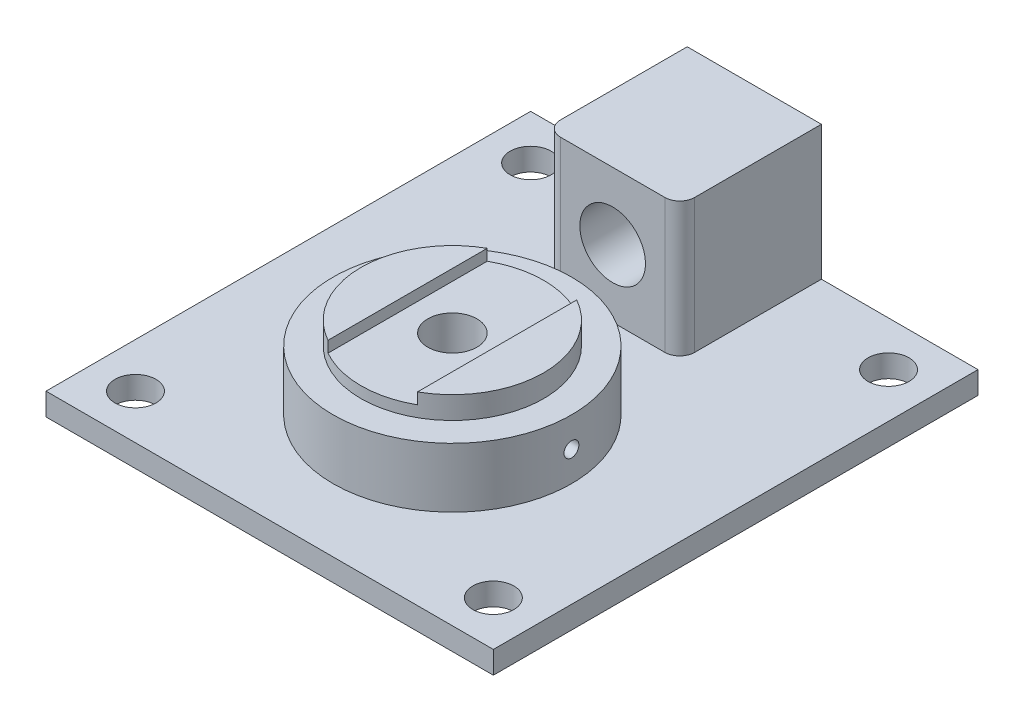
ISO-10303-21;
HEADER;
FILE_DESCRIPTION(('STEP AP214'),'2;1');
FILE_NAME('part.step','',(''),(''),'','','');
FILE_SCHEMA(('AUTOMOTIVE_DESIGN { 1 0 10303 214 1 1 1 1 }'));
ENDSEC;
DATA;
#1=APPLICATION_CONTEXT('core data for automotive mechanical design processes');
#2=APPLICATION_PROTOCOL_DEFINITION('international standard','automotive_design',2000,#1);
#3=PRODUCT_CONTEXT('',#1,'mechanical');
#4=PRODUCT('Part','Part','',(#3));
#5=PRODUCT_RELATED_PRODUCT_CATEGORY('part','',(#4));
#6=PRODUCT_DEFINITION_FORMATION('','',#4);
#7=PRODUCT_DEFINITION_CONTEXT('part definition',#1,'design');
#8=PRODUCT_DEFINITION('design','',#6,#7);
#9=PRODUCT_DEFINITION_SHAPE('','',#8);
#10=(LENGTH_UNIT() NAMED_UNIT(*) SI_UNIT(.MILLI.,.METRE.));
#11=(NAMED_UNIT(*) PLANE_ANGLE_UNIT() SI_UNIT($,.RADIAN.));
#12=(NAMED_UNIT(*) SI_UNIT($,.STERADIAN.) SOLID_ANGLE_UNIT());
#13=UNCERTAINTY_MEASURE_WITH_UNIT(LENGTH_MEASURE(1.E-05),#10,'distance_accuracy_value','');
#14=(GEOMETRIC_REPRESENTATION_CONTEXT(3) GLOBAL_UNCERTAINTY_ASSIGNED_CONTEXT((#13)) GLOBAL_UNIT_ASSIGNED_CONTEXT((#10,
#11,#12)) REPRESENTATION_CONTEXT('',''));
#15=CARTESIAN_POINT('',(0.,0.,0.));
#16=DIRECTION('',(0.,0.,1.));
#17=DIRECTION('',(1.,0.,0.));
#18=AXIS2_PLACEMENT_3D('',#15,#16,#17);
#19=CARTESIAN_POINT('',(-25.1769664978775,3.,27.2175));
#20=DIRECTION('',(0.,1.,0.));
#21=DIRECTION('',(0.,0.,1.));
#22=AXIS2_PLACEMENT_3D('',#19,#20,#21);
#23=PLANE('',#22);
#24=CARTESIAN_POINT('',(28.8230335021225,3.,-31.7825));
#25=DIRECTION('',(0.,1.,0.));
#26=DIRECTION('',(0.,0.,1.));
#27=AXIS2_PLACEMENT_3D('',#24,#25,#26);
#28=CIRCLE('',#27,2.74999999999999);
#29=CARTESIAN_POINT('',(28.8230335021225,3.,-29.0325));
#30=VERTEX_POINT('',#29);
#31=EDGE_CURVE('E633',#30,#30,#28,.T.);
#32=ORIENTED_EDGE('',*,*,#31,.F.);
#33=EDGE_LOOP('',(#32));
#34=FACE_BOUND('',#33,.T.);
#35=CARTESIAN_POINT('',(-19.1769664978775,3.,-31.7825));
#36=DIRECTION('',(0.,1.,0.));
#37=DIRECTION('',(0.,0.,1.));
#38=AXIS2_PLACEMENT_3D('',#35,#36,#37);
#39=CIRCLE('',#38,2.75);
#40=CARTESIAN_POINT('',(-19.1769664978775,3.,-29.0325));
#41=VERTEX_POINT('',#40);
#42=EDGE_CURVE('E627',#41,#41,#39,.T.);
#43=ORIENTED_EDGE('',*,*,#42,.F.);
#44=EDGE_LOOP('',(#43));
#45=FACE_BOUND('',#44,.T.);
#46=CARTESIAN_POINT('',(-19.1769664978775,3.,21.2175));
#47=DIRECTION('',(0.,1.,0.));
#48=DIRECTION('',(0.,0.,1.));
#49=AXIS2_PLACEMENT_3D('',#46,#47,#48);
#50=CIRCLE('',#49,2.75);
#51=CARTESIAN_POINT('',(-19.1769664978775,3.,23.9675));
#52=VERTEX_POINT('',#51);
#53=EDGE_CURVE('E621',#52,#52,#50,.T.);
#54=ORIENTED_EDGE('',*,*,#53,.F.);
#55=EDGE_LOOP('',(#54));
#56=FACE_BOUND('',#55,.T.);
#57=CARTESIAN_POINT('',(28.8230335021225,3.,21.2175));
#58=DIRECTION('',(0.,1.,0.));
#59=DIRECTION('',(0.,0.,1.));
#60=AXIS2_PLACEMENT_3D('',#57,#58,#59);
#61=CIRCLE('',#60,2.74999999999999);
#62=CARTESIAN_POINT('',(28.8230335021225,3.,23.9675));
#63=VERTEX_POINT('',#62);
#64=EDGE_CURVE('E615',#63,#63,#61,.T.);
#65=ORIENTED_EDGE('',*,*,#64,.F.);
#66=EDGE_LOOP('',(#65));
#67=FACE_BOUND('',#66,.T.);
#68=CARTESIAN_POINT('',(4.8230335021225,3.,2.7175));
#69=DIRECTION('',(0.,1.,0.));
#70=DIRECTION('',(0.,0.,1.));
#71=AXIS2_PLACEMENT_3D('',#68,#69,#70);
#72=CIRCLE('',#71,16.);
#73=CARTESIAN_POINT('',(4.8230335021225,3.,18.7175));
#74=VERTEX_POINT('',#73);
#75=EDGE_CURVE('E203',#74,#74,#72,.T.);
#76=ORIENTED_EDGE('',*,*,#75,.F.);
#77=EDGE_LOOP('',(#76));
#78=FACE_BOUND('',#77,.T.);
#79=DIRECTION('',(-1.,0.,0.));
#80=VECTOR('',#79,1.);
#81=CARTESIAN_POINT('',(-25.1769664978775,3.,-37.7825));
#82=LINE('',#81,#80);
#83=CARTESIAN_POINT('',(34.8230335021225,3.,-37.7825));
#84=VERTEX_POINT('',#83);
#85=CARTESIAN_POINT('',(13.8230335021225,3.,-37.7825));
#86=VERTEX_POINT('',#85);
#87=EDGE_CURVE('E222',#84,#86,#82,.T.);
#88=ORIENTED_EDGE('',*,*,#87,.T.);
#89=DIRECTION('',(0.,0.,-1.));
#90=VECTOR('',#89,1.);
#91=CARTESIAN_POINT('',(13.8230335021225,3.,-18.7825));
#92=LINE('',#91,#90);
#93=CARTESIAN_POINT('',(13.8230335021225,3.,-20.7825));
#94=VERTEX_POINT('',#93);
#95=EDGE_CURVE('E157',#94,#86,#92,.T.);
#96=ORIENTED_EDGE('',*,*,#95,.F.);
#97=CARTESIAN_POINT('',(11.8230335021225,3.,-20.7825));
#98=DIRECTION('',(0.,1.,0.));
#99=DIRECTION('',(0.,0.,1.));
#100=AXIS2_PLACEMENT_3D('',#97,#98,#99);
#101=CIRCLE('',#100,2.);
#102=CARTESIAN_POINT('',(11.8230335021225,3.,-18.7825));
#103=VERTEX_POINT('',#102);
#104=EDGE_CURVE('E11',#94,#103,#101,.F.);
#105=ORIENTED_EDGE('',*,*,#104,.T.);
#106=DIRECTION('',(1.,0.,0.));
#107=VECTOR('',#106,1.);
#108=CARTESIAN_POINT('',(-4.1769664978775,3.,-18.7825));
#109=LINE('',#108,#107);
#110=CARTESIAN_POINT('',(-2.1769664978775,3.,-18.7825));
#111=VERTEX_POINT('',#110);
#112=EDGE_CURVE('E143',#111,#103,#109,.T.);
#113=ORIENTED_EDGE('',*,*,#112,.F.);
#114=CARTESIAN_POINT('',(-2.1769664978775,3.,-20.7825));
#115=DIRECTION('',(0.,1.,0.));
#116=DIRECTION('',(0.,0.,1.));
#117=AXIS2_PLACEMENT_3D('',#114,#115,#116);
#118=CIRCLE('',#117,2.);
#119=CARTESIAN_POINT('',(-4.1769664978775,3.,-20.7825));
#120=VERTEX_POINT('',#119);
#121=EDGE_CURVE('E44',#111,#120,#118,.F.);
#122=ORIENTED_EDGE('',*,*,#121,.T.);
#123=DIRECTION('',(0.,0.,1.));
#124=VECTOR('',#123,1.);
#125=CARTESIAN_POINT('',(-4.1769664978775,3.,-18.7825));
#126=LINE('',#125,#124);
#127=CARTESIAN_POINT('',(-4.1769664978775,3.,-37.7825));
#128=VERTEX_POINT('',#127);
#129=EDGE_CURVE('E340',#128,#120,#126,.T.);
#130=ORIENTED_EDGE('',*,*,#129,.F.);
#131=CARTESIAN_POINT('',(-25.1769664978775,3.,-37.7825));
#132=VERTEX_POINT('',#131);
#133=EDGE_CURVE('E221',#128,#132,#82,.T.);
#134=ORIENTED_EDGE('',*,*,#133,.T.);
#135=DIRECTION('',(0.,0.,1.));
#136=VECTOR('',#135,1.);
#137=CARTESIAN_POINT('',(-25.1769664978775,3.,-37.7825));
#138=LINE('',#137,#136);
#139=CARTESIAN_POINT('',(-25.1769664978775,3.,27.2175));
#140=VERTEX_POINT('',#139);
#141=EDGE_CURVE('E213',#132,#140,#138,.T.);
#142=ORIENTED_EDGE('',*,*,#141,.T.);
#143=DIRECTION('',(1.,0.,0.));
#144=VECTOR('',#143,1.);
#145=CARTESIAN_POINT('',(-25.1769664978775,3.,27.2175));
#146=LINE('',#145,#144);
#147=CARTESIAN_POINT('',(34.8230335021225,3.,27.2175));
#148=VERTEX_POINT('',#147);
#149=EDGE_CURVE('E216',#140,#148,#146,.T.);
#150=ORIENTED_EDGE('',*,*,#149,.T.);
#151=DIRECTION('',(0.,0.,-1.));
#152=VECTOR('',#151,1.);
#153=CARTESIAN_POINT('',(34.8230335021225,3.,-37.7825));
#154=LINE('',#153,#152);
#155=EDGE_CURVE('E219',#148,#84,#154,.T.);
#156=ORIENTED_EDGE('',*,*,#155,.T.);
#157=EDGE_LOOP('',(#88,#96,#105,#113,#122,#130,#134,#142,#150,#156));
#158=FACE_BOUND('',#157,.T.);
#159=ADVANCED_FACE('F31',(#34,#45,#56,#67,#78,#158),#23,.T.);
#160=CARTESIAN_POINT('',(4.8230335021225,14.,2.7175));
#161=DIRECTION('',(0.,1.,0.));
#162=DIRECTION('',(0.,0.,1.));
#163=AXIS2_PLACEMENT_3D('',#160,#161,#162);
#164=PLANE('',#163);
#165=DIRECTION('',(0.,0.,-1.));
#166=VECTOR('',#165,1.);
#167=CARTESIAN_POINT('',(10.8230335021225,14.,-7.96250468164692));
#168=LINE('',#167,#166);
#169=CARTESIAN_POINT('',(10.8230335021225,14.,13.3975046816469));
#170=VERTEX_POINT('',#169);
#171=CARTESIAN_POINT('',(10.8230335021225,14.,-7.96250468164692));
#172=VERTEX_POINT('',#171);
#173=EDGE_CURVE('E178',#170,#172,#168,.T.);
#174=ORIENTED_EDGE('',*,*,#173,.F.);
#175=CARTESIAN_POINT('',(4.8230335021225,14.,2.7175));
#176=DIRECTION('',(0.,1.,0.));
#177=DIRECTION('',(0.,0.,1.));
#178=AXIS2_PLACEMENT_3D('',#175,#176,#177);
#179=CIRCLE('',#178,12.25);
#180=EDGE_CURVE('E200',#170,#172,#179,.T.);
#181=ORIENTED_EDGE('',*,*,#180,.T.);
#182=EDGE_LOOP('',(#174,#181));
#183=FACE_BOUND('',#182,.T.);
#184=ADVANCED_FACE('F300',(#183),#164,.T.);
#185=CARTESIAN_POINT('',(4.8230335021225,11.,2.7175));
#186=DIRECTION('',(0.,1.,0.));
#187=DIRECTION('',(0.,0.,1.));
#188=AXIS2_PLACEMENT_3D('',#185,#186,#187);
#189=PLANE('',#188);
#190=CARTESIAN_POINT('',(4.8230335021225,11.,2.7175));
#191=DIRECTION('',(0.,1.,0.));
#192=DIRECTION('',(0.,0.,1.));
#193=AXIS2_PLACEMENT_3D('',#190,#191,#192);
#194=CIRCLE('',#193,16.);
#195=CARTESIAN_POINT('',(4.8230335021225,11.,18.7175));
#196=VERTEX_POINT('',#195);
#197=EDGE_CURVE('E207',#196,#196,#194,.T.);
#198=ORIENTED_EDGE('',*,*,#197,.T.);
#199=EDGE_LOOP('',(#198));
#200=FACE_BOUND('',#199,.T.);
#201=CARTESIAN_POINT('',(4.8230335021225,11.,2.7175));
#202=DIRECTION('',(0.,1.,0.));
#203=DIRECTION('',(0.,0.,1.));
#204=AXIS2_PLACEMENT_3D('',#201,#202,#203);
#205=CIRCLE('',#204,12.25);
#206=CARTESIAN_POINT('',(4.8230335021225,11.,14.9675));
#207=VERTEX_POINT('',#206);
#208=EDGE_CURVE('E193',#207,#207,#205,.T.);
#209=ORIENTED_EDGE('',*,*,#208,.F.);
#210=EDGE_LOOP('',(#209));
#211=FACE_BOUND('',#210,.T.);
#212=ADVANCED_FACE('F295',(#200,#211),#189,.T.);
#213=CARTESIAN_POINT('',(-25.1769664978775,3.,-37.7825));
#214=DIRECTION('',(1.,0.,0.));
#215=DIRECTION('',(0.,0.,-1.));
#216=AXIS2_PLACEMENT_3D('',#213,#214,#215);
#217=PLANE('',#216);
#218=DIRECTION('',(0.,0.,1.));
#219=VECTOR('',#218,1.);
#220=CARTESIAN_POINT('',(-25.1769664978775,0.,-37.7825));
#221=LINE('',#220,#219);
#222=CARTESIAN_POINT('',(-25.1769664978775,0.,-37.7825));
#223=VERTEX_POINT('',#222);
#224=CARTESIAN_POINT('',(-25.1769664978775,0.,27.2175));
#225=VERTEX_POINT('',#224);
#226=EDGE_CURVE('E210',#223,#225,#221,.T.);
#227=ORIENTED_EDGE('',*,*,#226,.T.);
#228=DIRECTION('',(0.,-1.,0.));
#229=VECTOR('',#228,1.);
#230=CARTESIAN_POINT('',(-25.1769664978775,3.,27.2175));
#231=LINE('',#230,#229);
#232=EDGE_CURVE('E240',#140,#225,#231,.T.);
#233=ORIENTED_EDGE('',*,*,#232,.F.);
#234=ORIENTED_EDGE('',*,*,#141,.F.);
#235=DIRECTION('',(0.,-1.,0.));
#236=VECTOR('',#235,1.);
#237=CARTESIAN_POINT('',(-25.1769664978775,3.,-37.7825));
#238=LINE('',#237,#236);
#239=EDGE_CURVE('E224',#132,#223,#238,.T.);
#240=ORIENTED_EDGE('',*,*,#239,.T.);
#241=EDGE_LOOP('',(#227,#233,#234,#240));
#242=FACE_BOUND('',#241,.T.);
#243=ADVANCED_FACE('F315',(#242),#217,.F.);
#244=CARTESIAN_POINT('',(-25.1769664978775,3.,27.2175));
#245=DIRECTION('',(0.,0.,-1.));
#246=DIRECTION('',(-1.,0.,0.));
#247=AXIS2_PLACEMENT_3D('',#244,#245,#246);
#248=PLANE('',#247);
#249=DIRECTION('',(1.,0.,0.));
#250=VECTOR('',#249,1.);
#251=CARTESIAN_POINT('',(-25.1769664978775,0.,27.2175));
#252=LINE('',#251,#250);
#253=CARTESIAN_POINT('',(34.8230335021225,0.,27.2175));
#254=VERTEX_POINT('',#253);
#255=EDGE_CURVE('E227',#225,#254,#252,.T.);
#256=ORIENTED_EDGE('',*,*,#255,.T.);
#257=DIRECTION('',(0.,-1.,0.));
#258=VECTOR('',#257,1.);
#259=CARTESIAN_POINT('',(34.8230335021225,3.,27.2175));
#260=LINE('',#259,#258);
#261=EDGE_CURVE('E237',#148,#254,#260,.T.);
#262=ORIENTED_EDGE('',*,*,#261,.F.);
#263=ORIENTED_EDGE('',*,*,#149,.F.);
#264=ORIENTED_EDGE('',*,*,#232,.T.);
#265=EDGE_LOOP('',(#256,#262,#263,#264));
#266=FACE_BOUND('',#265,.T.);
#267=ADVANCED_FACE('F311',(#266),#248,.F.);
#268=CARTESIAN_POINT('',(34.8230335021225,3.,-37.7825));
#269=DIRECTION('',(-1.,0.,0.));
#270=DIRECTION('',(0.,0.,1.));
#271=AXIS2_PLACEMENT_3D('',#268,#269,#270);
#272=PLANE('',#271);
#273=DIRECTION('',(0.,0.,-1.));
#274=VECTOR('',#273,1.);
#275=CARTESIAN_POINT('',(34.8230335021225,0.,-37.7825));
#276=LINE('',#275,#274);
#277=CARTESIAN_POINT('',(34.8230335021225,0.,-37.7825));
#278=VERTEX_POINT('',#277);
#279=EDGE_CURVE('E229',#254,#278,#276,.T.);
#280=ORIENTED_EDGE('',*,*,#279,.T.);
#281=DIRECTION('',(0.,-1.,0.));
#282=VECTOR('',#281,1.);
#283=CARTESIAN_POINT('',(34.8230335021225,3.,-37.7825));
#284=LINE('',#283,#282);
#285=EDGE_CURVE('E234',#84,#278,#284,.T.);
#286=ORIENTED_EDGE('',*,*,#285,.F.);
#287=ORIENTED_EDGE('',*,*,#155,.F.);
#288=ORIENTED_EDGE('',*,*,#261,.T.);
#289=EDGE_LOOP('',(#280,#286,#287,#288));
#290=FACE_BOUND('',#289,.T.);
#291=ADVANCED_FACE('F307',(#290),#272,.F.);
#292=CARTESIAN_POINT('',(-25.1769664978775,3.,-37.7825));
#293=DIRECTION('',(0.,0.,1.));
#294=DIRECTION('',(1.,0.,0.));
#295=AXIS2_PLACEMENT_3D('',#292,#293,#294);
#296=PLANE('',#295);
#297=CARTESIAN_POINT('',(4.8230335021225,12.,-37.7825));
#298=DIRECTION('',(0.,0.,-1.));
#299=DIRECTION('',(-1.,0.,0.));
#300=AXIS2_PLACEMENT_3D('',#297,#298,#299);
#301=CIRCLE('',#300,4.39999999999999);
#302=CARTESIAN_POINT('',(0.423033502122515,12.,-37.7825));
#303=VERTEX_POINT('',#302);
#304=EDGE_CURVE('E610',#303,#303,#301,.T.);
#305=ORIENTED_EDGE('',*,*,#304,.F.);
#306=EDGE_LOOP('',(#305));
#307=FACE_BOUND('',#306,.T.);
#308=DIRECTION('',(-1.,0.,0.));
#309=VECTOR('',#308,1.);
#310=CARTESIAN_POINT('',(-25.1769664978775,0.,-37.7825));
#311=LINE('',#310,#309);
#312=EDGE_CURVE('E217',#278,#223,#311,.T.);
#313=ORIENTED_EDGE('',*,*,#312,.T.);
#314=ORIENTED_EDGE('',*,*,#239,.F.);
#315=ORIENTED_EDGE('',*,*,#133,.F.);
#316=DIRECTION('',(0.,-1.,0.));
#317=VECTOR('',#316,1.);
#318=CARTESIAN_POINT('',(-4.1769664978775,21.,-37.7825));
#319=LINE('',#318,#317);
#320=CARTESIAN_POINT('',(-4.1769664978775,21.,-37.7825));
#321=VERTEX_POINT('',#320);
#322=EDGE_CURVE('E151',#321,#128,#319,.T.);
#323=ORIENTED_EDGE('',*,*,#322,.F.);
#324=DIRECTION('',(-1.,0.,0.));
#325=VECTOR('',#324,1.);
#326=CARTESIAN_POINT('',(-4.1769664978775,21.,-37.7825));
#327=LINE('',#326,#325);
#328=CARTESIAN_POINT('',(13.8230335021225,21.,-37.7825));
#329=VERTEX_POINT('',#328);
#330=EDGE_CURVE('E139',#329,#321,#327,.T.);
#331=ORIENTED_EDGE('',*,*,#330,.F.);
#332=DIRECTION('',(0.,-1.,0.));
#333=VECTOR('',#332,1.);
#334=CARTESIAN_POINT('',(13.8230335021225,21.,-37.7825));
#335=LINE('',#334,#333);
#336=EDGE_CURVE('E149',#329,#86,#335,.T.);
#337=ORIENTED_EDGE('',*,*,#336,.T.);
#338=ORIENTED_EDGE('',*,*,#87,.F.);
#339=ORIENTED_EDGE('',*,*,#285,.T.);
#340=EDGE_LOOP('',(#313,#314,#315,#323,#331,#337,#338,#339));
#341=FACE_BOUND('',#340,.T.);
#342=ADVANCED_FACE('F147',(#307,#341),#296,.F.);
#343=CARTESIAN_POINT('',(-25.1769664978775,0.,27.2175));
#344=DIRECTION('',(0.,1.,0.));
#345=DIRECTION('',(0.,0.,1.));
#346=AXIS2_PLACEMENT_3D('',#343,#344,#345);
#347=PLANE('',#346);
#348=CARTESIAN_POINT('',(28.8230335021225,0.,-31.7825));
#349=DIRECTION('',(0.,1.,0.));
#350=DIRECTION('',(0.,0.,1.));
#351=AXIS2_PLACEMENT_3D('',#348,#349,#350);
#352=CIRCLE('',#351,2.74999999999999);
#353=CARTESIAN_POINT('',(28.8230335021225,0.,-29.0325));
#354=VERTEX_POINT('',#353);
#355=EDGE_CURVE('E630',#354,#354,#352,.T.);
#356=ORIENTED_EDGE('',*,*,#355,.T.);
#357=EDGE_LOOP('',(#356));
#358=FACE_BOUND('',#357,.T.);
#359=CARTESIAN_POINT('',(-19.1769664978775,0.,-31.7825));
#360=DIRECTION('',(0.,1.,0.));
#361=DIRECTION('',(0.,0.,1.));
#362=AXIS2_PLACEMENT_3D('',#359,#360,#361);
#363=CIRCLE('',#362,2.75);
#364=CARTESIAN_POINT('',(-19.1769664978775,0.,-29.0325));
#365=VERTEX_POINT('',#364);
#366=EDGE_CURVE('E624',#365,#365,#363,.T.);
#367=ORIENTED_EDGE('',*,*,#366,.T.);
#368=EDGE_LOOP('',(#367));
#369=FACE_BOUND('',#368,.T.);
#370=CARTESIAN_POINT('',(-19.1769664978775,0.,21.2175));
#371=DIRECTION('',(0.,1.,0.));
#372=DIRECTION('',(0.,0.,1.));
#373=AXIS2_PLACEMENT_3D('',#370,#371,#372);
#374=CIRCLE('',#373,2.75);
#375=CARTESIAN_POINT('',(-19.1769664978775,0.,23.9675));
#376=VERTEX_POINT('',#375);
#377=EDGE_CURVE('E619',#376,#376,#374,.T.);
#378=ORIENTED_EDGE('',*,*,#377,.T.);
#379=EDGE_LOOP('',(#378));
#380=FACE_BOUND('',#379,.T.);
#381=CARTESIAN_POINT('',(28.8230335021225,0.,21.2175));
#382=DIRECTION('',(0.,1.,0.));
#383=DIRECTION('',(0.,0.,1.));
#384=AXIS2_PLACEMENT_3D('',#381,#382,#383);
#385=CIRCLE('',#384,2.74999999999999);
#386=CARTESIAN_POINT('',(28.8230335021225,0.,23.9675));
#387=VERTEX_POINT('',#386);
#388=EDGE_CURVE('E611',#387,#387,#385,.T.);
#389=ORIENTED_EDGE('',*,*,#388,.T.);
#390=EDGE_LOOP('',(#389));
#391=FACE_BOUND('',#390,.T.);
#392=CARTESIAN_POINT('',(4.8230335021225,0.,2.71749999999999));
#393=DIRECTION('',(0.,-1.,0.));
#394=DIRECTION('',(0.,0.,-1.));
#395=AXIS2_PLACEMENT_3D('',#392,#393,#394);
#396=CIRCLE('',#395,5.75);
#397=CARTESIAN_POINT('',(4.8230335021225,0.,-3.03250000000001));
#398=VERTEX_POINT('',#397);
#399=EDGE_CURVE('E159',#398,#398,#396,.T.);
#400=ORIENTED_EDGE('',*,*,#399,.F.);
#401=EDGE_LOOP('',(#400));
#402=FACE_BOUND('',#401,.T.);
#403=ORIENTED_EDGE('',*,*,#226,.F.);
#404=ORIENTED_EDGE('',*,*,#312,.F.);
#405=ORIENTED_EDGE('',*,*,#279,.F.);
#406=ORIENTED_EDGE('',*,*,#255,.F.);
#407=EDGE_LOOP('',(#403,#404,#405,#406));
#408=FACE_BOUND('',#407,.T.);
#409=ADVANCED_FACE('F293',(#358,#369,#380,#391,#402,#408),#347,.F.);
#410=CARTESIAN_POINT('',(4.8230335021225,11.,2.7175));
#411=DIRECTION('',(0.,-1.,0.));
#412=DIRECTION('',(0.,0.,-1.));
#413=AXIS2_PLACEMENT_3D('',#410,#411,#412);
#414=CYLINDRICAL_SURFACE('',#413,16.);
#415=CARTESIAN_POINT('',(-11.1456859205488,7.,1.7175));
#416=CARTESIAN_POINT('',(-11.1456863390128,7.0561115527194,1.71750246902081));
#417=CARTESIAN_POINT('',(-11.1459848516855,7.11226239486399,1.72223863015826));
#418=CARTESIAN_POINT('',(-11.1471467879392,7.2230136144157,1.74106412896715));
#419=CARTESIAN_POINT('',(-11.1480108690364,7.27761210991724,1.75516435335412));
#420=CARTESIAN_POINT('',(-11.1502056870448,7.38363835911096,1.79231138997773));
#421=CARTESIAN_POINT('',(-11.1515361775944,7.43506776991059,1.81535347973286));
#422=CARTESIAN_POINT('',(-11.1545135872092,7.53331542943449,1.86972252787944));
#423=CARTESIAN_POINT('',(-11.1561604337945,7.58013473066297,1.90104758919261));
#424=CARTESIAN_POINT('',(-11.1595877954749,7.66791696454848,1.97114501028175));
#425=CARTESIAN_POINT('',(-11.1613684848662,7.70887205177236,2.00992718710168));
#426=CARTESIAN_POINT('',(-11.1648612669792,7.78369615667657,2.09381771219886));
#427=CARTESIAN_POINT('',(-11.1665733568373,7.81756487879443,2.13892632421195));
#428=CARTESIAN_POINT('',(-11.1697375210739,7.8772787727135,2.23423329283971));
#429=CARTESIAN_POINT('',(-11.1711893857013,7.90311748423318,2.28443570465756));
#430=CARTESIAN_POINT('',(-11.173667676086,7.94599651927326,2.38847676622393));
#431=CARTESIAN_POINT('',(-11.1746941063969,7.96303693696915,2.4423153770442));
#432=CARTESIAN_POINT('',(-11.1762046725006,7.98781398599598,2.55202525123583));
#433=CARTESIAN_POINT('',(-11.1766895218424,7.99556286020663,2.6078937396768));
#434=CARTESIAN_POINT('',(-11.1770646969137,8.001574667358,2.72014039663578));
#435=CARTESIAN_POINT('',(-11.1769550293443,7.99983770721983,2.77651855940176));
#436=CARTESIAN_POINT('',(-11.1761541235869,7.98693725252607,2.88810126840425));
#437=CARTESIAN_POINT('',(-11.1754636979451,7.97578692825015,2.94330734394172));
#438=CARTESIAN_POINT('',(-11.1735799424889,7.94439669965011,3.05106269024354));
#439=CARTESIAN_POINT('',(-11.1723866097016,7.9241567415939,3.10361194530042));
#440=CARTESIAN_POINT('',(-11.1696300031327,7.87514687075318,3.20460424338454));
#441=CARTESIAN_POINT('',(-11.1680664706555,7.8463709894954,3.25304438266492));
#442=CARTESIAN_POINT('',(-11.1647454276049,7.78111045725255,3.3444116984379));
#443=CARTESIAN_POINT('',(-11.1629879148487,7.74462571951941,3.38733881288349));
#444=CARTESIAN_POINT('',(-11.1594731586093,7.6649087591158,3.4665384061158));
#445=CARTESIAN_POINT('',(-11.1577159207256,7.62166510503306,3.50279938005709));
#446=CARTESIAN_POINT('',(-11.1544028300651,7.5296978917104,3.5675486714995));
#447=CARTESIAN_POINT('',(-11.1528469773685,7.48097433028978,3.5960369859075));
#448=CARTESIAN_POINT('',(-11.1501123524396,7.37942307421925,3.64443145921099));
#449=CARTESIAN_POINT('',(-11.1489336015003,7.32659514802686,3.66433713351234));
#450=CARTESIAN_POINT('',(-11.1470868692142,7.21833810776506,3.69499333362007));
#451=CARTESIAN_POINT('',(-11.1464188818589,7.16290902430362,3.70574396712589));
#452=CARTESIAN_POINT('',(-11.1456701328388,7.05112345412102,3.71777058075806));
#453=CARTESIAN_POINT('',(-11.1455883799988,6.99476869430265,3.71906255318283));
#454=CARTESIAN_POINT('',(-11.1460187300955,6.88264326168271,3.71217695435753));
#455=CARTESIAN_POINT('',(-11.1465308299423,6.82687258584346,3.70399943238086));
#456=CARTESIAN_POINT('',(-11.1480902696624,6.71754367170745,3.67842025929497));
#457=CARTESIAN_POINT('',(-11.1491371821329,6.66398370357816,3.66102597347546));
#458=CARTESIAN_POINT('',(-11.1516479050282,6.56054318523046,3.61751449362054));
#459=CARTESIAN_POINT('',(-11.1531117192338,6.51066266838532,3.59139722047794));
#460=CARTESIAN_POINT('',(-11.1562936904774,6.41592351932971,3.53114027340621));
#461=CARTESIAN_POINT('',(-11.158012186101,6.37107171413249,3.49698988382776));
#462=CARTESIAN_POINT('',(-11.1615086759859,6.28773194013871,3.42165170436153));
#463=CARTESIAN_POINT('',(-11.1632866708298,6.24924403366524,3.38046384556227));
#464=CARTESIAN_POINT('',(-11.1667047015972,6.17967057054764,3.29215107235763));
#465=CARTESIAN_POINT('',(-11.1683445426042,6.14859536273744,3.24501799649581));
#466=CARTESIAN_POINT('',(-11.1712986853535,6.09480022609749,3.14619377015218));
#467=CARTESIAN_POINT('',(-11.1726129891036,6.0720802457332,3.09450264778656));
#468=CARTESIAN_POINT('',(-11.1747670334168,6.03565850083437,2.98806769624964));
#469=CARTESIAN_POINT('',(-11.1756071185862,6.02195018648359,2.93332611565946));
#470=CARTESIAN_POINT('',(-11.1767194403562,6.00391946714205,2.82231289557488));
#471=CARTESIAN_POINT('',(-11.1769916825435,5.9995969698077,2.76604127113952));
#472=CARTESIAN_POINT('',(-11.1769376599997,6.00046148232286,2.65366774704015));
#473=CARTESIAN_POINT('',(-11.1766124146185,6.00563229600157,2.59756572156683));
#474=CARTESIAN_POINT('',(-11.1754020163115,6.02530307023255,2.48702813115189));
#475=CARTESIAN_POINT('',(-11.1745168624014,6.03980304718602,2.43259256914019));
#476=CARTESIAN_POINT('',(-11.1722861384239,6.07771689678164,2.32693068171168));
#477=CARTESIAN_POINT('',(-11.1709405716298,6.10113070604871,2.27570433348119));
#478=CARTESIAN_POINT('',(-11.1679400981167,6.15620532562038,2.17790772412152));
#479=CARTESIAN_POINT('',(-11.1662851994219,6.18786592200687,2.13133734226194));
#480=CARTESIAN_POINT('',(-11.1628488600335,6.25859519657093,2.0440925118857));
#481=CARTESIAN_POINT('',(-11.1610672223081,6.29767557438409,2.00342755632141));
#482=CARTESIAN_POINT('',(-11.1575797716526,6.38211952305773,1.92922128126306));
#483=CARTESIAN_POINT('',(-11.1558739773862,6.42748462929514,1.89568170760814));
#484=CARTESIAN_POINT('',(-11.1527289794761,6.52326214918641,1.83665341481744));
#485=CARTESIAN_POINT('',(-11.1512901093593,6.57368075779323,1.81117474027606));
#486=CARTESIAN_POINT('',(-11.1488461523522,6.67805250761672,1.76907543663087));
#487=CARTESIAN_POINT('',(-11.1478405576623,6.73200142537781,1.75244443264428));
#488=CARTESIAN_POINT('',(-11.1466405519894,6.82190033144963,1.73283511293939));
#489=CARTESIAN_POINT('',(-11.146284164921,6.85726921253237,1.72709188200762));
#490=CARTESIAN_POINT('',(-11.145806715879,6.92842006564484,1.71942354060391));
#491=CARTESIAN_POINT('',(-11.1456856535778,6.96420203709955,1.71749842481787));
#492=CARTESIAN_POINT('',(-11.1456859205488,7.,1.7175));
#493=B_SPLINE_CURVE_WITH_KNOTS('',3,(#415,#416,#417,#418,#419,#420,#421,#422,#423,#424,#425,
#426,#427,#428,#429,#430,#431,#432,#433,#434,#435,#436,#437,#438,#439,#440,#441,#442,#443,#444,
#445,#446,#447,#448,#449,#450,#451,#452,#453,#454,#455,#456,#457,#458,#459,#460,#461,#462,#463,
#464,#465,#466,#467,#468,#469,#470,#471,#472,#473,#474,#475,#476,#477,#478,#479,#480,#481,#482,
#483,#484,#485,#486,#487,#488,#489,#490,#491,#492),.UNSPECIFIED.,.T.,.F.,(4,2,2,2,2,2,2,2,2,2,2,
2,2,2,2,2,2,2,2,2,2,2,2,2,2,2,2,2,2,2,2,2,2,2,2,2,2,2,4),(0.,0.168203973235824,
0.336603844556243,0.504914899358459,0.673187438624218,0.841683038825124,1.01018566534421,
1.17882350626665,1.3474595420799,1.51587313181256,1.68428482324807,1.85246127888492,
2.02063872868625,2.18893404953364,2.35723126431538,2.52581626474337,2.69440133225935,
2.86299591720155,3.03158851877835,3.1998960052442,3.36820261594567,3.53637493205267,
3.70454877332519,3.87294823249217,4.04134934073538,4.20998419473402,4.37861800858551,
4.54712912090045,4.71563857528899,4.88386080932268,5.05208333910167,5.22030467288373,
5.38852164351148,5.55700609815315,5.72553178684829,5.89426665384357,6.06280322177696,
6.17011388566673,6.27742440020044),.UNSPECIFIED.);
#494=CARTESIAN_POINT('',(-11.1456859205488,7.,1.7175));
#495=VERTEX_POINT('',#494);
#496=EDGE_CURVE('E283',#495,#495,#493,.T.);
#497=ORIENTED_EDGE('',*,*,#496,.T.);
#498=EDGE_LOOP('',(#497));
#499=FACE_BOUND('',#498,.T.);
#500=CARTESIAN_POINT('',(20.7917529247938,7.,1.7175));
#501=CARTESIAN_POINT('',(20.7917533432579,6.9438884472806,1.71750246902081));
#502=CARTESIAN_POINT('',(20.7920518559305,6.88773760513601,1.72223863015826));
#503=CARTESIAN_POINT('',(20.7932137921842,6.7769863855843,1.74106412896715));
#504=CARTESIAN_POINT('',(20.7940778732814,6.72238789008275,1.75516435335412));
#505=CARTESIAN_POINT('',(20.7962726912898,6.61636164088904,1.79231138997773));
#506=CARTESIAN_POINT('',(20.7976031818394,6.5649322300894,1.81535347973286));
#507=CARTESIAN_POINT('',(20.8005805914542,6.46668457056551,1.86972252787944));
#508=CARTESIAN_POINT('',(20.8022274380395,6.41986526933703,1.90104758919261));
#509=CARTESIAN_POINT('',(20.8056547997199,6.33208303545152,1.97114501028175));
#510=CARTESIAN_POINT('',(20.8074354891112,6.29112794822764,2.00992718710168));
#511=CARTESIAN_POINT('',(20.8109282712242,6.21630384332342,2.09381771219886));
#512=CARTESIAN_POINT('',(20.8126403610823,6.18243512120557,2.13892632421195));
#513=CARTESIAN_POINT('',(20.8158045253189,6.1227212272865,2.23423329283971));
#514=CARTESIAN_POINT('',(20.8172563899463,6.09688251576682,2.28443570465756));
#515=CARTESIAN_POINT('',(20.819734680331,6.05400348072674,2.38847676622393));
#516=CARTESIAN_POINT('',(20.8207611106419,6.03696306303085,2.4423153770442));
#517=CARTESIAN_POINT('',(20.8222716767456,6.01218601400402,2.55202525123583));
#518=CARTESIAN_POINT('',(20.8227565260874,6.00443713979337,2.6078937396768));
#519=CARTESIAN_POINT('',(20.8231317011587,5.998425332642,2.72014039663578));
#520=CARTESIAN_POINT('',(20.8230220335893,6.00016229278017,2.77651855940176));
#521=CARTESIAN_POINT('',(20.8222211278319,6.01306274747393,2.88810126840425));
#522=CARTESIAN_POINT('',(20.8215307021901,6.02421307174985,2.94330734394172));
#523=CARTESIAN_POINT('',(20.8196469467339,6.05560330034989,3.05106269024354));
#524=CARTESIAN_POINT('',(20.8184536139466,6.0758432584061,3.10361194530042));
#525=CARTESIAN_POINT('',(20.8156970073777,6.12485312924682,3.20460424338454));
#526=CARTESIAN_POINT('',(20.8141334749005,6.15362901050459,3.25304438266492));
#527=CARTESIAN_POINT('',(20.8108124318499,6.21888954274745,3.3444116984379));
#528=CARTESIAN_POINT('',(20.8090549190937,6.25537428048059,3.38733881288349));
#529=CARTESIAN_POINT('',(20.8055401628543,6.3350912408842,3.4665384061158));
#530=CARTESIAN_POINT('',(20.8037829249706,6.37833489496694,3.50279938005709));
#531=CARTESIAN_POINT('',(20.8004698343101,6.4703021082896,3.5675486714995));
#532=CARTESIAN_POINT('',(20.7989139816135,6.51902566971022,3.5960369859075));
#533=CARTESIAN_POINT('',(20.7961793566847,6.62057692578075,3.64443145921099));
#534=CARTESIAN_POINT('',(20.7950006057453,6.67340485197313,3.66433713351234));
#535=CARTESIAN_POINT('',(20.7931538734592,6.78166189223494,3.69499333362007));
#536=CARTESIAN_POINT('',(20.7924858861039,6.83709097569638,3.70574396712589));
#537=CARTESIAN_POINT('',(20.7917371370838,6.94887654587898,3.71777058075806));
#538=CARTESIAN_POINT('',(20.7916553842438,7.00523130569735,3.71906255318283));
#539=CARTESIAN_POINT('',(20.7920857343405,7.11735673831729,3.71217695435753));
#540=CARTESIAN_POINT('',(20.7925978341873,7.17312741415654,3.70399943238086));
#541=CARTESIAN_POINT('',(20.7941572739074,7.28245632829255,3.67842025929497));
#542=CARTESIAN_POINT('',(20.7952041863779,7.33601629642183,3.66102597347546));
#543=CARTESIAN_POINT('',(20.7977149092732,7.43945681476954,3.61751449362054));
#544=CARTESIAN_POINT('',(20.7991787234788,7.48933733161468,3.59139722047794));
#545=CARTESIAN_POINT('',(20.8023606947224,7.58407648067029,3.53114027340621));
#546=CARTESIAN_POINT('',(20.804079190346,7.62892828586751,3.49698988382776));
#547=CARTESIAN_POINT('',(20.8075756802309,7.71226805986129,3.42165170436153));
#548=CARTESIAN_POINT('',(20.8093536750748,7.75075596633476,3.38046384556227));
#549=CARTESIAN_POINT('',(20.8127717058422,7.82032942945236,3.29215107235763));
#550=CARTESIAN_POINT('',(20.8144115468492,7.85140463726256,3.24501799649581));
#551=CARTESIAN_POINT('',(20.8173656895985,7.90519977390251,3.14619377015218));
#552=CARTESIAN_POINT('',(20.8186799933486,7.9279197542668,3.09450264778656));
#553=CARTESIAN_POINT('',(20.8208340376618,7.96434149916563,2.98806769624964));
#554=CARTESIAN_POINT('',(20.8216741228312,7.97804981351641,2.93332611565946));
#555=CARTESIAN_POINT('',(20.8227864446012,7.99608053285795,2.82231289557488));
#556=CARTESIAN_POINT('',(20.8230586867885,8.0004030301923,2.76604127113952));
#557=CARTESIAN_POINT('',(20.8230046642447,7.99953851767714,2.65366774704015));
#558=CARTESIAN_POINT('',(20.8226794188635,7.99436770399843,2.59756572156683));
#559=CARTESIAN_POINT('',(20.8214690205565,7.97469692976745,2.48702813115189));
#560=CARTESIAN_POINT('',(20.8205838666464,7.96019695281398,2.43259256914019));
#561=CARTESIAN_POINT('',(20.8183531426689,7.92228310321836,2.32693068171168));
#562=CARTESIAN_POINT('',(20.8170075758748,7.89886929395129,2.27570433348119));
#563=CARTESIAN_POINT('',(20.8140071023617,7.84379467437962,2.17790772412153));
#564=CARTESIAN_POINT('',(20.8123522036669,7.81213407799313,2.13133734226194));
#565=CARTESIAN_POINT('',(20.8089158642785,7.74140480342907,2.0440925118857));
#566=CARTESIAN_POINT('',(20.8071342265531,7.70232442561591,2.00342755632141));
#567=CARTESIAN_POINT('',(20.8036467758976,7.61788047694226,1.92922128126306));
#568=CARTESIAN_POINT('',(20.8019409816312,7.57251537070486,1.89568170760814));
#569=CARTESIAN_POINT('',(20.7987959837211,7.47673785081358,1.83665341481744));
#570=CARTESIAN_POINT('',(20.7973571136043,7.42631924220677,1.81117474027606));
#571=CARTESIAN_POINT('',(20.7949131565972,7.32194749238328,1.76907543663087));
#572=CARTESIAN_POINT('',(20.7939075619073,7.26799857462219,1.75244443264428));
#573=CARTESIAN_POINT('',(20.7927075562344,7.17809966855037,1.73283511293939));
#574=CARTESIAN_POINT('',(20.792351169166,7.14273078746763,1.72709188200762));
#575=CARTESIAN_POINT('',(20.791873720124,7.07157993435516,1.71942354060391));
#576=CARTESIAN_POINT('',(20.7917526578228,7.03579796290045,1.71749842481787));
#577=CARTESIAN_POINT('',(20.7917529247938,7.,1.7175));
#578=B_SPLINE_CURVE_WITH_KNOTS('',3,(#500,#501,#502,#503,#504,#505,#506,#507,#508,#509,#510,
#511,#512,#513,#514,#515,#516,#517,#518,#519,#520,#521,#522,#523,#524,#525,#526,#527,#528,#529,
#530,#531,#532,#533,#534,#535,#536,#537,#538,#539,#540,#541,#542,#543,#544,#545,#546,#547,#548,
#549,#550,#551,#552,#553,#554,#555,#556,#557,#558,#559,#560,#561,#562,#563,#564,#565,#566,#567,
#568,#569,#570,#571,#572,#573,#574,#575,#576,#577),.UNSPECIFIED.,.T.,.F.,(4,2,2,2,2,2,2,2,2,2,2,
2,2,2,2,2,2,2,2,2,2,2,2,2,2,2,2,2,2,2,2,2,2,2,2,2,2,2,4),(0.,0.168203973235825,
0.336603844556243,0.504914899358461,0.673187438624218,0.841683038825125,1.01018566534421,
1.17882350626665,1.3474595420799,1.51587313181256,1.68428482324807,1.85246127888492,
2.02063872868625,2.18893404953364,2.35723126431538,2.52581626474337,2.69440133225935,
2.86299591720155,3.03158851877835,3.1998960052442,3.36820261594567,3.53637493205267,
3.70454877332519,3.87294823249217,4.04134934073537,4.20998419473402,4.37861800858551,
4.54712912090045,4.71563857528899,4.88386080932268,5.05208333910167,5.22030467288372,
5.38852164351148,5.55700609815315,5.72553178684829,5.89426665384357,6.06280322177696,
6.17011388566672,6.27742440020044),.UNSPECIFIED.);
#579=CARTESIAN_POINT('',(20.7917529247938,7.,1.7175));
#580=VERTEX_POINT('',#579);
#581=EDGE_CURVE('E278',#580,#580,#578,.T.);
#582=ORIENTED_EDGE('',*,*,#581,.T.);
#583=EDGE_LOOP('',(#582));
#584=FACE_BOUND('',#583,.T.);
#585=ORIENTED_EDGE('',*,*,#197,.F.);
#586=EDGE_LOOP('',(#585));
#587=FACE_BOUND('',#586,.T.);
#588=ORIENTED_EDGE('',*,*,#75,.T.);
#589=EDGE_LOOP('',(#588));
#590=FACE_BOUND('',#589,.T.);
#591=ADVANCED_FACE('F287',(#499,#584,#587,#590),#414,.T.);
#592=CARTESIAN_POINT('',(4.8230335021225,14.,2.7175));
#593=DIRECTION('',(0.,-1.,0.));
#594=DIRECTION('',(0.,0.,-1.));
#595=AXIS2_PLACEMENT_3D('',#592,#593,#594);
#596=CYLINDRICAL_SURFACE('',#595,12.25);
#597=ORIENTED_EDGE('',*,*,#180,.F.);
#598=DIRECTION('',(0.,1.,0.));
#599=VECTOR('',#598,1.);
#600=CARTESIAN_POINT('',(10.8230335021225,12.5,13.3975046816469));
#601=LINE('',#600,#599);
#602=CARTESIAN_POINT('',(10.8230335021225,12.5,13.3975046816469));
#603=VERTEX_POINT('',#602);
#604=EDGE_CURVE('E194',#603,#170,#601,.T.);
#605=ORIENTED_EDGE('',*,*,#604,.F.);
#606=CARTESIAN_POINT('',(4.8230335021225,12.5,2.7175));
#607=DIRECTION('',(0.,1.,0.));
#608=DIRECTION('',(0.,0.,1.));
#609=AXIS2_PLACEMENT_3D('',#606,#607,#608);
#610=CIRCLE('',#609,12.25);
#611=CARTESIAN_POINT('',(-1.1769664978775,12.5,13.3975046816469));
#612=VERTEX_POINT('',#611);
#613=EDGE_CURVE('E181',#612,#603,#610,.T.);
#614=ORIENTED_EDGE('',*,*,#613,.F.);
#615=DIRECTION('',(0.,1.,0.));
#616=VECTOR('',#615,1.);
#617=CARTESIAN_POINT('',(-1.1769664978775,12.5,13.3975046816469));
#618=LINE('',#617,#616);
#619=CARTESIAN_POINT('',(-1.1769664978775,14.,13.3975046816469));
#620=VERTEX_POINT('',#619);
#621=EDGE_CURVE('E196',#612,#620,#618,.T.);
#622=ORIENTED_EDGE('',*,*,#621,.T.);
#623=CARTESIAN_POINT('',(-1.1769664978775,14.,-7.96250468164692));
#624=VERTEX_POINT('',#623);
#625=EDGE_CURVE('E204',#624,#620,#179,.T.);
#626=ORIENTED_EDGE('',*,*,#625,.F.);
#627=DIRECTION('',(0.,1.,0.));
#628=VECTOR('',#627,1.);
#629=CARTESIAN_POINT('',(-1.1769664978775,12.5,-7.96250468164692));
#630=LINE('',#629,#628);
#631=CARTESIAN_POINT('',(-1.1769664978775,12.5,-7.96250468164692));
#632=VERTEX_POINT('',#631);
#633=EDGE_CURVE('E186',#632,#624,#630,.T.);
#634=ORIENTED_EDGE('',*,*,#633,.F.);
#635=CARTESIAN_POINT('',(4.8230335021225,12.5,2.7175));
#636=DIRECTION('',(0.,1.,0.));
#637=DIRECTION('',(0.,0.,-1.));
#638=AXIS2_PLACEMENT_3D('',#635,#636,#637);
#639=CIRCLE('',#638,12.25);
#640=CARTESIAN_POINT('',(10.8230335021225,12.5,-7.96250468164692));
#641=VERTEX_POINT('',#640);
#642=EDGE_CURVE('E174',#641,#632,#639,.T.);
#643=ORIENTED_EDGE('',*,*,#642,.F.);
#644=DIRECTION('',(0.,1.,0.));
#645=VECTOR('',#644,1.);
#646=CARTESIAN_POINT('',(10.8230335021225,12.5,-7.96250468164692));
#647=LINE('',#646,#645);
#648=EDGE_CURVE('E190',#641,#172,#647,.T.);
#649=ORIENTED_EDGE('',*,*,#648,.T.);
#650=EDGE_LOOP('',(#597,#605,#614,#622,#626,#634,#643,#649));
#651=FACE_BOUND('',#650,.T.);
#652=ORIENTED_EDGE('',*,*,#208,.T.);
#653=EDGE_LOOP('',(#652));
#654=FACE_BOUND('',#653,.T.);
#655=ADVANCED_FACE('F292',(#651,#654),#596,.T.);
#656=DIRECTION('',(0.,0.,1.));
#657=VECTOR('',#656,1.);
#658=CARTESIAN_POINT('',(-1.1769664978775,14.,-7.96250468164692));
#659=LINE('',#658,#657);
#660=EDGE_CURVE('E187',#624,#620,#659,.T.);
#661=ORIENTED_EDGE('',*,*,#660,.F.);
#662=ORIENTED_EDGE('',*,*,#625,.T.);
#663=EDGE_LOOP('',(#661,#662));
#664=FACE_BOUND('',#663,.T.);
#665=ADVANCED_FACE('F404',(#664),#164,.T.);
#666=CARTESIAN_POINT('',(10.8230335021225,12.5,-7.96250468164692));
#667=DIRECTION('',(1.,0.,0.));
#668=DIRECTION('',(0.,0.,-1.));
#669=AXIS2_PLACEMENT_3D('',#666,#667,#668);
#670=PLANE('',#669);
#671=ORIENTED_EDGE('',*,*,#173,.T.);
#672=ORIENTED_EDGE('',*,*,#648,.F.);
#673=DIRECTION('',(0.,0.,-1.));
#674=VECTOR('',#673,1.);
#675=CARTESIAN_POINT('',(10.8230335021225,12.5,-7.96250468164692));
#676=LINE('',#675,#674);
#677=EDGE_CURVE('E183',#603,#641,#676,.T.);
#678=ORIENTED_EDGE('',*,*,#677,.F.);
#679=ORIENTED_EDGE('',*,*,#604,.T.);
#680=EDGE_LOOP('',(#671,#672,#678,#679));
#681=FACE_BOUND('',#680,.T.);
#682=ADVANCED_FACE('F406',(#681),#670,.F.);
#683=CARTESIAN_POINT('',(-1.1769664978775,12.5,-7.96250468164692));
#684=DIRECTION('',(-1.,0.,0.));
#685=DIRECTION('',(0.,0.,1.));
#686=AXIS2_PLACEMENT_3D('',#683,#684,#685);
#687=PLANE('',#686);
#688=ORIENTED_EDGE('',*,*,#660,.T.);
#689=ORIENTED_EDGE('',*,*,#621,.F.);
#690=DIRECTION('',(0.,0.,1.));
#691=VECTOR('',#690,1.);
#692=CARTESIAN_POINT('',(-1.1769664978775,12.5,-7.96250468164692));
#693=LINE('',#692,#691);
#694=EDGE_CURVE('E177',#632,#612,#693,.T.);
#695=ORIENTED_EDGE('',*,*,#694,.F.);
#696=ORIENTED_EDGE('',*,*,#633,.T.);
#697=EDGE_LOOP('',(#688,#689,#695,#696));
#698=FACE_BOUND('',#697,.T.);
#699=ADVANCED_FACE('F391',(#698),#687,.F.);
#700=CARTESIAN_POINT('',(4.8230335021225,12.5,2.7175));
#701=DIRECTION('',(0.,-1.,0.));
#702=DIRECTION('',(0.,0.,-1.));
#703=AXIS2_PLACEMENT_3D('',#700,#701,#702);
#704=PLANE('',#703);
#705=CARTESIAN_POINT('',(4.8230335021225,12.5,2.71749999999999));
#706=DIRECTION('',(0.,-1.,0.));
#707=DIRECTION('',(0.,0.,-1.));
#708=AXIS2_PLACEMENT_3D('',#705,#706,#707);
#709=CIRCLE('',#708,3.3);
#710=CARTESIAN_POINT('',(4.8230335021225,12.5,-0.582500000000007));
#711=VERTEX_POINT('',#710);
#712=EDGE_CURVE('E173',#711,#711,#709,.T.);
#713=ORIENTED_EDGE('',*,*,#712,.T.);
#714=EDGE_LOOP('',(#713));
#715=FACE_BOUND('',#714,.T.);
#716=ORIENTED_EDGE('',*,*,#642,.T.);
#717=ORIENTED_EDGE('',*,*,#694,.T.);
#718=ORIENTED_EDGE('',*,*,#613,.T.);
#719=ORIENTED_EDGE('',*,*,#677,.T.);
#720=EDGE_LOOP('',(#716,#717,#718,#719));
#721=FACE_BOUND('',#720,.T.);
#722=ADVANCED_FACE('F377',(#715,#721),#704,.F.);
#723=CARTESIAN_POINT('',(4.8230335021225,0.,2.71749999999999));
#724=DIRECTION('',(0.,-1.,0.));
#725=DIRECTION('',(0.,0.,-1.));
#726=AXIS2_PLACEMENT_3D('',#723,#724,#725);
#727=CYLINDRICAL_SURFACE('',#726,3.3);
#728=CARTESIAN_POINT('',(1.67819646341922,7.,1.7175));
#729=CARTESIAN_POINT('',(1.67819594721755,6.94523194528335,1.7175006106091));
#730=CARTESIAN_POINT('',(1.67675010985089,6.89045785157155,1.72201460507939));
#731=CARTESIAN_POINT('',(1.67114667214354,6.78251290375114,1.73990357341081));
#732=CARTESIAN_POINT('',(1.66698820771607,6.72934256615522,1.75328137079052));
#733=CARTESIAN_POINT('',(1.65647280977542,6.62618364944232,1.78840049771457));
#734=CARTESIAN_POINT('',(1.65011959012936,6.57618986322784,1.81012770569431));
#735=CARTESIAN_POINT('',(1.63593558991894,6.48054431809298,1.86128232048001));
#736=CARTESIAN_POINT('',(1.62810457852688,6.43489323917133,1.89071093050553));
#737=CARTESIAN_POINT('',(1.61156373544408,6.34775477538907,1.95745050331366));
#738=CARTESIAN_POINT('',(1.60283489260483,6.30642832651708,1.99496692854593));
#739=CARTESIAN_POINT('',(1.58564415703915,6.23054665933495,2.0763770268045));
#740=CARTESIAN_POINT('',(1.57718229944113,6.1959923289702,2.12027153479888));
#741=CARTESIAN_POINT('',(1.56126264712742,6.13393421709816,2.21433944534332));
#742=CARTESIAN_POINT('',(1.55382985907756,6.10659492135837,2.26462596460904));
#743=CARTESIAN_POINT('',(1.54102696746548,6.06082362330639,2.36934643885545));
#744=CARTESIAN_POINT('',(1.53565640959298,6.04238965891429,2.42377947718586));
#745=CARTESIAN_POINT('',(1.52771762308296,6.01548602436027,2.53356381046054));
#746=CARTESIAN_POINT('',(1.52507227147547,6.00674156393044,2.58884208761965));
#747=CARTESIAN_POINT('',(1.52261017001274,5.9985958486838,2.70014023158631));
#748=CARTESIAN_POINT('',(1.5227928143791,5.99919259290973,2.75615993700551));
#749=CARTESIAN_POINT('',(1.52591180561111,6.00952877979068,2.8654214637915));
#750=CARTESIAN_POINT('',(1.52875850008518,6.01897057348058,2.91869440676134));
#751=CARTESIAN_POINT('',(1.53677646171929,6.04624210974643,3.02286066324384));
#752=CARTESIAN_POINT('',(1.54194787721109,6.06407238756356,3.07375382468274));
#753=CARTESIAN_POINT('',(1.55415729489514,6.10781382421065,3.17241840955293));
#754=CARTESIAN_POINT('',(1.56121659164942,6.13381780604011,3.22014593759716));
#755=CARTESIAN_POINT('',(1.57645419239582,6.19309482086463,3.31065451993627));
#756=CARTESIAN_POINT('',(1.58463276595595,6.22636960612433,3.3534343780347));
#757=CARTESIAN_POINT('',(1.60161414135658,6.30078368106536,3.43460923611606));
#758=CARTESIAN_POINT('',(1.61042884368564,6.34218064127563,3.47276585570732));
#759=CARTESIAN_POINT('',(1.62740886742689,6.43087083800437,3.54166357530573));
#760=CARTESIAN_POINT('',(1.63557412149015,6.47816468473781,3.57240390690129));
#761=CARTESIAN_POINT('',(1.65038837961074,6.577944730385,3.62585184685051));
#762=CARTESIAN_POINT('',(1.6570214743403,6.63047794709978,3.64847641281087));
#763=CARTESIAN_POINT('',(1.66783215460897,6.73885690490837,3.6844860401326));
#764=CARTESIAN_POINT('',(1.6720105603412,6.79470153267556,3.69787418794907));
#765=CARTESIAN_POINT('',(1.67725826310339,6.90584571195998,3.71458194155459));
#766=CARTESIAN_POINT('',(1.67843958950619,6.96108544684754,3.71826454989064));
#767=CARTESIAN_POINT('',(1.67786946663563,7.07139568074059,3.71647167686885));
#768=CARTESIAN_POINT('',(1.67611843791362,7.12646620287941,3.71099750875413));
#769=CARTESIAN_POINT('',(1.6699910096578,7.23334908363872,3.69137002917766));
#770=CARTESIAN_POINT('',(1.66568587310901,7.28520916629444,3.67745208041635));
#771=CARTESIAN_POINT('',(1.65500954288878,7.38585396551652,3.64160584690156));
#772=CARTESIAN_POINT('',(1.64863802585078,7.4346381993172,3.61967630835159));
#773=CARTESIAN_POINT('',(1.63433079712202,7.5292187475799,3.5677454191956));
#774=CARTESIAN_POINT('',(1.62635714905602,7.57489721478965,3.53754015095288));
#775=CARTESIAN_POINT('',(1.60982486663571,7.66066968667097,3.47015639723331));
#776=CARTESIAN_POINT('',(1.60126608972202,7.70076232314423,3.43297620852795));
#777=CARTESIAN_POINT('',(1.58412790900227,7.77582082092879,3.3509887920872));
#778=CARTESIAN_POINT('',(1.57556047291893,7.81052890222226,3.30594247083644));
#779=CARTESIAN_POINT('',(1.55970252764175,7.87190052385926,3.21045996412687));
#780=CARTESIAN_POINT('',(1.55241195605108,7.89856445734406,3.16002404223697));
#781=CARTESIAN_POINT('',(1.53997310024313,7.94283367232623,3.05552264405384));
#782=CARTESIAN_POINT('',(1.53480896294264,7.96050622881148,3.00148764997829));
#783=CARTESIAN_POINT('',(1.52713488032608,7.98646007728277,2.8910297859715));
#784=CARTESIAN_POINT('',(1.52462415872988,7.9947441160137,2.83460761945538));
#785=CARTESIAN_POINT('',(1.52258805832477,8.00147345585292,2.72335702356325));
#786=CARTESIAN_POINT('',(1.52294935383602,8.00029222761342,2.66855298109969));
#787=CARTESIAN_POINT('',(1.52634855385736,7.98901984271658,2.5599585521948));
#788=CARTESIAN_POINT('',(1.52938630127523,7.97892920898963,2.50616810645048));
#789=CARTESIAN_POINT('',(1.5377639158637,7.95035722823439,2.40171313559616));
#790=CARTESIAN_POINT('',(1.54307773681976,7.93197069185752,2.35102044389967));
#791=CARTESIAN_POINT('',(1.55545843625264,7.88741381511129,2.25341347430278));
#792=CARTESIAN_POINT('',(1.56252560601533,7.86124218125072,2.20649982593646));
#793=CARTESIAN_POINT('',(1.57795707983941,7.80087336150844,2.11612661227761));
#794=CARTESIAN_POINT('',(1.5863560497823,7.7664431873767,2.07282865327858));
#795=CARTESIAN_POINT('',(1.60339612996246,7.69095213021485,1.99250025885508));
#796=CARTESIAN_POINT('',(1.61203730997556,7.64988931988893,1.95547165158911));
#797=CARTESIAN_POINT('',(1.62889530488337,7.56079151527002,1.88759407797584));
#798=CARTESIAN_POINT('',(1.63709105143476,7.51258166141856,1.8569688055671));
#799=CARTESIAN_POINT('',(1.65178710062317,7.41145843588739,1.80429223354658));
#800=CARTESIAN_POINT('',(1.65828818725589,7.35854725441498,1.78223696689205));
#801=CARTESIAN_POINT('',(1.66824221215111,7.25510870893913,1.74922409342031));
#802=CARTESIAN_POINT('',(1.67193924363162,7.20489270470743,1.73736084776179));
#803=CARTESIAN_POINT('',(1.67691635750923,7.10311939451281,1.72149934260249));
#804=CARTESIAN_POINT('',(1.6781969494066,7.05156237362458,1.71749942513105));
#805=CARTESIAN_POINT('',(1.67819646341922,7.,1.7175));
#806=B_SPLINE_CURVE_WITH_KNOTS('',3,(#728,#729,#730,#731,#732,#733,#734,#735,#736,#737,#738,
#739,#740,#741,#742,#743,#744,#745,#746,#747,#748,#749,#750,#751,#752,#753,#754,#755,#756,#757,
#758,#759,#760,#761,#762,#763,#764,#765,#766,#767,#768,#769,#770,#771,#772,#773,#774,#775,#776,
#777,#778,#779,#780,#781,#782,#783,#784,#785,#786,#787,#788,#789,#790,#791,#792,#793,#794,#795,
#796,#797,#798,#799,#800,#801,#802,#803,#804,#805),.UNSPECIFIED.,.T.,.F.,(4,2,2,2,2,2,2,2,2,2,2,
2,2,2,2,2,2,2,2,2,2,2,2,2,2,2,2,2,2,2,2,2,2,2,2,2,2,2,4),(0.,0.164113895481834,
0.328280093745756,0.492169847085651,0.656085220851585,0.824797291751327,0.993531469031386,
1.16583258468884,1.33809572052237,1.5053374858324,1.67254342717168,1.83431734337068,
1.99610158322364,2.15979384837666,2.32352560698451,2.49369165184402,2.66387532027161,
2.83575376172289,3.00757474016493,3.17287163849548,3.33814483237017,3.4990102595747,
3.6599008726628,3.82518148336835,3.99050250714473,4.16220793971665,4.33390497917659,
4.50429772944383,4.67464061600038,4.83829638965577,5.00194255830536,5.16376407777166,
5.32561249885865,5.492715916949,5.65986797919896,5.83213340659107,6.0043189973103,
6.1588595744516,6.31336756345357),.UNSPECIFIED.);
#807=CARTESIAN_POINT('',(1.67819646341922,7.,1.7175));
#808=VERTEX_POINT('',#807);
#809=EDGE_CURVE('E35',#808,#808,#806,.T.);
#810=ORIENTED_EDGE('',*,*,#809,.T.);
#811=EDGE_LOOP('',(#810));
#812=FACE_BOUND('',#811,.T.);
#813=CARTESIAN_POINT('',(7.96787054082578,7.,1.7175));
#814=CARTESIAN_POINT('',(7.96787105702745,7.05476805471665,1.7175006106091));
#815=CARTESIAN_POINT('',(7.96931689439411,7.10954214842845,1.72201460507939));
#816=CARTESIAN_POINT('',(7.97492033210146,7.21748709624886,1.73990357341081));
#817=CARTESIAN_POINT('',(7.97907879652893,7.27065743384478,1.75328137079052));
#818=CARTESIAN_POINT('',(7.98959419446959,7.37381635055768,1.78840049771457));
#819=CARTESIAN_POINT('',(7.99594741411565,7.42381013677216,1.81012770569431));
#820=CARTESIAN_POINT('',(8.01013141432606,7.51945568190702,1.86128232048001));
#821=CARTESIAN_POINT('',(8.01796242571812,7.56510676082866,1.89071093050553));
#822=CARTESIAN_POINT('',(8.03450326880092,7.65224522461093,1.95745050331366));
#823=CARTESIAN_POINT('',(8.04323211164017,7.69357167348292,1.99496692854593));
#824=CARTESIAN_POINT('',(8.06042284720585,7.76945334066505,2.0763770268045));
#825=CARTESIAN_POINT('',(8.06888470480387,7.8040076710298,2.12027153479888));
#826=CARTESIAN_POINT('',(8.08480435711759,7.86606578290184,2.21433944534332));
#827=CARTESIAN_POINT('',(8.09223714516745,7.89340507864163,2.26462596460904));
#828=CARTESIAN_POINT('',(8.10504003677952,7.93917637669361,2.36934643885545));
#829=CARTESIAN_POINT('',(8.11041059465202,7.95761034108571,2.42377947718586));
#830=CARTESIAN_POINT('',(8.11834938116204,7.98451397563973,2.53356381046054));
#831=CARTESIAN_POINT('',(8.12099473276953,7.99325843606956,2.58884208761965));
#832=CARTESIAN_POINT('',(8.12345683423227,8.0014041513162,2.70014023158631));
#833=CARTESIAN_POINT('',(8.1232741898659,8.00080740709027,2.75615993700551));
#834=CARTESIAN_POINT('',(8.12015519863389,7.99047122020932,2.8654214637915));
#835=CARTESIAN_POINT('',(8.11730850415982,7.98102942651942,2.91869440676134));
#836=CARTESIAN_POINT('',(8.10929054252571,7.95375789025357,3.02286066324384));
#837=CARTESIAN_POINT('',(8.10411912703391,7.93592761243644,3.07375382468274));
#838=CARTESIAN_POINT('',(8.09190970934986,7.89218617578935,3.17241840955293));
#839=CARTESIAN_POINT('',(8.08485041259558,7.86618219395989,3.22014593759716));
#840=CARTESIAN_POINT('',(8.06961281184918,7.80690517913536,3.31065451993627));
#841=CARTESIAN_POINT('',(8.06143423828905,7.77363039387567,3.3534343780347));
#842=CARTESIAN_POINT('',(8.04445286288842,7.69921631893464,3.43460923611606));
#843=CARTESIAN_POINT('',(8.03563816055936,7.65781935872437,3.47276585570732));
#844=CARTESIAN_POINT('',(8.01865813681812,7.56912916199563,3.54166357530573));
#845=CARTESIAN_POINT('',(8.01049288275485,7.52183531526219,3.57240390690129));
#846=CARTESIAN_POINT('',(7.99567862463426,7.42205526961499,3.62585184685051));
#847=CARTESIAN_POINT('',(7.9890455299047,7.36952205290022,3.64847641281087));
#848=CARTESIAN_POINT('',(7.97823484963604,7.26114309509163,3.6844860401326));
#849=CARTESIAN_POINT('',(7.9740564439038,7.20529846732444,3.69787418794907));
#850=CARTESIAN_POINT('',(7.96880874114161,7.09415428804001,3.71458194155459));
#851=CARTESIAN_POINT('',(7.96762741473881,7.03891455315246,3.71826454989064));
#852=CARTESIAN_POINT('',(7.96819753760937,6.92860431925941,3.71647167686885));
#853=CARTESIAN_POINT('',(7.96994856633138,6.87353379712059,3.71099750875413));
#854=CARTESIAN_POINT('',(7.9760759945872,6.76665091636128,3.69137002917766));
#855=CARTESIAN_POINT('',(7.98038113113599,6.71479083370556,3.67745208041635));
#856=CARTESIAN_POINT('',(7.99105746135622,6.61414603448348,3.64160584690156));
#857=CARTESIAN_POINT('',(7.99742897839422,6.5653618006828,3.61967630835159));
#858=CARTESIAN_POINT('',(8.01173620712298,6.4707812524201,3.5677454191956));
#859=CARTESIAN_POINT('',(8.01970985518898,6.42510278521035,3.53754015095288));
#860=CARTESIAN_POINT('',(8.03624213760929,6.33933031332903,3.47015639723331));
#861=CARTESIAN_POINT('',(8.04480091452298,6.29923767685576,3.43297620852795));
#862=CARTESIAN_POINT('',(8.06193909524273,6.22417917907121,3.3509887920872));
#863=CARTESIAN_POINT('',(8.07050653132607,6.18947109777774,3.30594247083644));
#864=CARTESIAN_POINT('',(8.08636447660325,6.12809947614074,3.21045996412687));
#865=CARTESIAN_POINT('',(8.09365504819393,6.10143554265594,3.16002404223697));
#866=CARTESIAN_POINT('',(8.10609390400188,6.05716632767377,3.05552264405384));
#867=CARTESIAN_POINT('',(8.11125804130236,6.03949377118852,3.00148764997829));
#868=CARTESIAN_POINT('',(8.11893212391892,6.01353992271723,2.8910297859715));
#869=CARTESIAN_POINT('',(8.12144284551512,6.0052558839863,2.83460761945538));
#870=CARTESIAN_POINT('',(8.12347894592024,5.99852654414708,2.72335702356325));
#871=CARTESIAN_POINT('',(8.12311765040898,5.99970777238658,2.66855298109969));
#872=CARTESIAN_POINT('',(8.11971845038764,6.01098015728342,2.5599585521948));
#873=CARTESIAN_POINT('',(8.11668070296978,6.02107079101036,2.50616810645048));
#874=CARTESIAN_POINT('',(8.10830308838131,6.04964277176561,2.40171313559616));
#875=CARTESIAN_POINT('',(8.10298926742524,6.06802930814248,2.35102044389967));
#876=CARTESIAN_POINT('',(8.09060856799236,6.1125861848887,2.25341347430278));
#877=CARTESIAN_POINT('',(8.08354139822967,6.13875781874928,2.20649982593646));
#878=CARTESIAN_POINT('',(8.06810992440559,6.19912663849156,2.11612661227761));
#879=CARTESIAN_POINT('',(8.0597109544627,6.2335568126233,2.07282865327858));
#880=CARTESIAN_POINT('',(8.04267087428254,6.30904786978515,1.99250025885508));
#881=CARTESIAN_POINT('',(8.03402969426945,6.35011068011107,1.95547165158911));
#882=CARTESIAN_POINT('',(8.01717169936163,6.43920848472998,1.88759407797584));
#883=CARTESIAN_POINT('',(8.00897595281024,6.48741833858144,1.8569688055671));
#884=CARTESIAN_POINT('',(7.99427990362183,6.58854156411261,1.80429223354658));
#885=CARTESIAN_POINT('',(7.98777881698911,6.64145274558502,1.78223696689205));
#886=CARTESIAN_POINT('',(7.97782479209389,6.74489129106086,1.74922409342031));
#887=CARTESIAN_POINT('',(7.97412776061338,6.79510729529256,1.73736084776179));
#888=CARTESIAN_POINT('',(7.96915064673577,6.89688060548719,1.72149934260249));
#889=CARTESIAN_POINT('',(7.9678700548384,6.94843762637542,1.71749942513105));
#890=CARTESIAN_POINT('',(7.96787054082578,7.,1.7175));
#891=B_SPLINE_CURVE_WITH_KNOTS('',3,(#813,#814,#815,#816,#817,#818,#819,#820,#821,#822,#823,
#824,#825,#826,#827,#828,#829,#830,#831,#832,#833,#834,#835,#836,#837,#838,#839,#840,#841,#842,
#843,#844,#845,#846,#847,#848,#849,#850,#851,#852,#853,#854,#855,#856,#857,#858,#859,#860,#861,
#862,#863,#864,#865,#866,#867,#868,#869,#870,#871,#872,#873,#874,#875,#876,#877,#878,#879,#880,
#881,#882,#883,#884,#885,#886,#887,#888,#889,#890),.UNSPECIFIED.,.T.,.F.,(4,2,2,2,2,2,2,2,2,2,2,
2,2,2,2,2,2,2,2,2,2,2,2,2,2,2,2,2,2,2,2,2,2,2,2,2,2,2,4),(0.,0.164113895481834,
0.328280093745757,0.492169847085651,0.656085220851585,0.824797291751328,0.993531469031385,
1.16583258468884,1.33809572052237,1.5053374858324,1.67254342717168,1.83431734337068,
1.99610158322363,2.15979384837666,2.32352560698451,2.49369165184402,2.6638753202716,
2.83575376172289,3.00757474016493,3.17287163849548,3.33814483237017,3.4990102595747,
3.6599008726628,3.82518148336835,3.99050250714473,4.16220793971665,4.33390497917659,
4.50429772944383,4.67464061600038,4.83829638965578,5.00194255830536,5.16376407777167,
5.32561249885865,5.492715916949,5.65986797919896,5.83213340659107,6.0043189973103,
6.1588595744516,6.31336756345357),.UNSPECIFIED.);
#892=CARTESIAN_POINT('',(7.96787054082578,7.,1.7175));
#893=VERTEX_POINT('',#892);
#894=EDGE_CURVE('E257',#893,#893,#891,.T.);
#895=ORIENTED_EDGE('',*,*,#894,.T.);
#896=EDGE_LOOP('',(#895));
#897=FACE_BOUND('',#896,.T.);
#898=CARTESIAN_POINT('',(4.8230335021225,3.3,2.71749999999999));
#899=DIRECTION('',(0.,-1.,0.));
#900=DIRECTION('',(0.,0.,-1.));
#901=AXIS2_PLACEMENT_3D('',#898,#899,#900);
#902=CIRCLE('',#901,3.3);
#903=CARTESIAN_POINT('',(4.8230335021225,3.3,-0.58250000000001));
#904=VERTEX_POINT('',#903);
#905=EDGE_CURVE('E170',#904,#904,#902,.T.);
#906=ORIENTED_EDGE('',*,*,#905,.T.);
#907=EDGE_LOOP('',(#906));
#908=FACE_BOUND('',#907,.T.);
#909=ORIENTED_EDGE('',*,*,#712,.F.);
#910=EDGE_LOOP('',(#909));
#911=FACE_BOUND('',#910,.T.);
#912=ADVANCED_FACE('F261',(#812,#897,#908,#911),#727,.F.);
#913=CARTESIAN_POINT('',(8.1230335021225,3.3,2.71749999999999));
#914=DIRECTION('',(0.,1.,0.));
#915=DIRECTION('',(0.,0.,1.));
#916=AXIS2_PLACEMENT_3D('',#913,#914,#915);
#917=PLANE('',#916);
#918=ORIENTED_EDGE('',*,*,#905,.F.);
#919=EDGE_LOOP('',(#918));
#920=FACE_BOUND('',#919,.T.);
#921=CARTESIAN_POINT('',(4.8230335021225,3.3,2.71749999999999));
#922=DIRECTION('',(0.,-1.,0.));
#923=DIRECTION('',(0.,0.,-1.));
#924=AXIS2_PLACEMENT_3D('',#921,#922,#923);
#925=CIRCLE('',#924,5.75);
#926=CARTESIAN_POINT('',(4.8230335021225,3.3,-3.03250000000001));
#927=VERTEX_POINT('',#926);
#928=EDGE_CURVE('E162',#927,#927,#925,.T.);
#929=ORIENTED_EDGE('',*,*,#928,.T.);
#930=EDGE_LOOP('',(#929));
#931=FACE_BOUND('',#930,.T.);
#932=ADVANCED_FACE('F369',(#920,#931),#917,.F.);
#933=CARTESIAN_POINT('',(4.8230335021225,0.,2.71749999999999));
#934=DIRECTION('',(0.,-1.,0.));
#935=DIRECTION('',(0.,0.,-1.));
#936=AXIS2_PLACEMENT_3D('',#933,#934,#935);
#937=CYLINDRICAL_SURFACE('',#936,5.75);
#938=ORIENTED_EDGE('',*,*,#928,.F.);
#939=EDGE_LOOP('',(#938));
#940=FACE_BOUND('',#939,.T.);
#941=ORIENTED_EDGE('',*,*,#399,.T.);
#942=EDGE_LOOP('',(#941));
#943=FACE_BOUND('',#942,.T.);
#944=ADVANCED_FACE('F364',(#940,#943),#937,.F.);
#945=CARTESIAN_POINT('',(13.8230335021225,21.,-18.7825));
#946=DIRECTION('',(-1.,0.,0.));
#947=DIRECTION('',(0.,0.,1.));
#948=AXIS2_PLACEMENT_3D('',#945,#946,#947);
#949=PLANE('',#948);
#950=DIRECTION('',(0.,0.,-1.));
#951=VECTOR('',#950,1.);
#952=CARTESIAN_POINT('',(13.8230335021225,21.,-18.7825));
#953=LINE('',#952,#951);
#954=CARTESIAN_POINT('',(13.8230335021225,21.,-20.7825));
#955=VERTEX_POINT('',#954);
#956=EDGE_CURVE('E135',#955,#329,#953,.T.);
#957=ORIENTED_EDGE('',*,*,#956,.F.);
#958=DIRECTION('',(0.,-1.,0.));
#959=VECTOR('',#958,1.);
#960=CARTESIAN_POINT('',(13.8230335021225,21.,-20.7825));
#961=LINE('',#960,#959);
#962=EDGE_CURVE('E255',#955,#94,#961,.T.);
#963=ORIENTED_EDGE('',*,*,#962,.T.);
#964=ORIENTED_EDGE('',*,*,#95,.T.);
#965=ORIENTED_EDGE('',*,*,#336,.F.);
#966=EDGE_LOOP('',(#957,#963,#964,#965));
#967=FACE_BOUND('',#966,.T.);
#968=ADVANCED_FACE('F155',(#967),#949,.F.);
#969=CARTESIAN_POINT('',(-4.1769664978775,21.,-18.7825));
#970=DIRECTION('',(1.,0.,0.));
#971=DIRECTION('',(0.,0.,-1.));
#972=AXIS2_PLACEMENT_3D('',#969,#970,#971);
#973=PLANE('',#972);
#974=ORIENTED_EDGE('',*,*,#129,.T.);
#975=DIRECTION('',(0.,-1.,0.));
#976=VECTOR('',#975,1.);
#977=CARTESIAN_POINT('',(-4.1769664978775,21.,-20.7825));
#978=LINE('',#977,#976);
#979=CARTESIAN_POINT('',(-4.1769664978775,21.,-20.7825));
#980=VERTEX_POINT('',#979);
#981=EDGE_CURVE('E250',#120,#980,#978,.F.);
#982=ORIENTED_EDGE('',*,*,#981,.T.);
#983=DIRECTION('',(0.,0.,1.));
#984=VECTOR('',#983,1.);
#985=CARTESIAN_POINT('',(-4.1769664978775,21.,-18.7825));
#986=LINE('',#985,#984);
#987=EDGE_CURVE('E153',#321,#980,#986,.T.);
#988=ORIENTED_EDGE('',*,*,#987,.F.);
#989=ORIENTED_EDGE('',*,*,#322,.T.);
#990=EDGE_LOOP('',(#974,#982,#988,#989));
#991=FACE_BOUND('',#990,.T.);
#992=ADVANCED_FACE('F355',(#991),#973,.F.);
#993=CARTESIAN_POINT('',(-4.1769664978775,21.,-18.7825));
#994=DIRECTION('',(0.,0.,-1.));
#995=DIRECTION('',(-1.,0.,0.));
#996=AXIS2_PLACEMENT_3D('',#993,#994,#995);
#997=PLANE('',#996);
#998=CARTESIAN_POINT('',(4.8230335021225,12.,-18.7825));
#999=DIRECTION('',(0.,0.,-1.));
#1000=DIRECTION('',(-1.,0.,0.));
#1001=AXIS2_PLACEMENT_3D('',#998,#999,#1000);
#1002=CIRCLE('',#1001,4.39999999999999);
#1003=CARTESIAN_POINT('',(0.423033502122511,12.,-18.7825));
#1004=VERTEX_POINT('',#1003);
#1005=EDGE_CURVE('E341',#1004,#1004,#1002,.T.);
#1006=ORIENTED_EDGE('',*,*,#1005,.T.);
#1007=EDGE_LOOP('',(#1006));
#1008=FACE_BOUND('',#1007,.T.);
#1009=DIRECTION('',(1.,0.,0.));
#1010=VECTOR('',#1009,1.);
#1011=CARTESIAN_POINT('',(-4.1769664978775,21.,-18.7825));
#1012=LINE('',#1011,#1010);
#1013=CARTESIAN_POINT('',(-2.1769664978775,21.,-18.7825));
#1014=VERTEX_POINT('',#1013);
#1015=CARTESIAN_POINT('',(11.8230335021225,21.,-18.7825));
#1016=VERTEX_POINT('',#1015);
#1017=EDGE_CURVE('E164',#1014,#1016,#1012,.T.);
#1018=ORIENTED_EDGE('',*,*,#1017,.F.);
#1019=DIRECTION('',(0.,-1.,0.));
#1020=VECTOR('',#1019,1.);
#1021=CARTESIAN_POINT('',(-2.1769664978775,21.,-18.7825));
#1022=LINE('',#1021,#1020);
#1023=EDGE_CURVE('E247',#1014,#111,#1022,.T.);
#1024=ORIENTED_EDGE('',*,*,#1023,.T.);
#1025=ORIENTED_EDGE('',*,*,#112,.T.);
#1026=DIRECTION('',(0.,-1.,0.));
#1027=VECTOR('',#1026,1.);
#1028=CARTESIAN_POINT('',(11.8230335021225,21.,-18.7825));
#1029=LINE('',#1028,#1027);
#1030=EDGE_CURVE('E243',#103,#1016,#1029,.F.);
#1031=ORIENTED_EDGE('',*,*,#1030,.T.);
#1032=EDGE_LOOP('',(#1018,#1024,#1025,#1031));
#1033=FACE_BOUND('',#1032,.T.);
#1034=ADVANCED_FACE('F333',(#1008,#1033),#997,.F.);
#1035=CARTESIAN_POINT('',(13.8230335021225,21.,-37.7825));
#1036=DIRECTION('',(0.,-1.,0.));
#1037=DIRECTION('',(0.,0.,-1.));
#1038=AXIS2_PLACEMENT_3D('',#1035,#1036,#1037);
#1039=PLANE('',#1038);
#1040=ORIENTED_EDGE('',*,*,#987,.T.);
#1041=CARTESIAN_POINT('',(-2.1769664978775,21.,-20.7825));
#1042=DIRECTION('',(0.,-1.,0.));
#1043=DIRECTION('',(0.,0.,-1.));
#1044=AXIS2_PLACEMENT_3D('',#1041,#1042,#1043);
#1045=CIRCLE('',#1044,2.);
#1046=EDGE_CURVE('E253',#980,#1014,#1045,.F.);
#1047=ORIENTED_EDGE('',*,*,#1046,.T.);
#1048=ORIENTED_EDGE('',*,*,#1017,.T.);
#1049=CARTESIAN_POINT('',(11.8230335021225,21.,-20.7825));
#1050=DIRECTION('',(0.,-1.,0.));
#1051=DIRECTION('',(0.,0.,-1.));
#1052=AXIS2_PLACEMENT_3D('',#1049,#1050,#1051);
#1053=CIRCLE('',#1052,2.);
#1054=EDGE_CURVE('E58',#1016,#955,#1053,.F.);
#1055=ORIENTED_EDGE('',*,*,#1054,.T.);
#1056=ORIENTED_EDGE('',*,*,#956,.T.);
#1057=ORIENTED_EDGE('',*,*,#330,.T.);
#1058=EDGE_LOOP('',(#1040,#1047,#1048,#1055,#1056,#1057));
#1059=FACE_BOUND('',#1058,.T.);
#1060=ADVANCED_FACE('F138',(#1059),#1039,.F.);
#1061=CARTESIAN_POINT('',(4.8230335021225,12.,-37.7825));
#1062=DIRECTION('',(0.,0.,-1.));
#1063=DIRECTION('',(-1.,0.,0.));
#1064=AXIS2_PLACEMENT_3D('',#1061,#1062,#1063);
#1065=CYLINDRICAL_SURFACE('',#1064,4.39999999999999);
#1066=ORIENTED_EDGE('',*,*,#1005,.F.);
#1067=EDGE_LOOP('',(#1066));
#1068=FACE_BOUND('',#1067,.T.);
#1069=ORIENTED_EDGE('',*,*,#304,.T.);
#1070=EDGE_LOOP('',(#1069));
#1071=FACE_BOUND('',#1070,.T.);
#1072=ADVANCED_FACE('F529',(#1068,#1071),#1065,.F.);
#1073=CARTESIAN_POINT('',(28.8230335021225,0.,21.2175));
#1074=DIRECTION('',(0.,1.,0.));
#1075=DIRECTION('',(0.,0.,1.));
#1076=AXIS2_PLACEMENT_3D('',#1073,#1074,#1075);
#1077=CYLINDRICAL_SURFACE('',#1076,2.74999999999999);
#1078=ORIENTED_EDGE('',*,*,#388,.F.);
#1079=EDGE_LOOP('',(#1078));
#1080=FACE_BOUND('',#1079,.T.);
#1081=ORIENTED_EDGE('',*,*,#64,.T.);
#1082=EDGE_LOOP('',(#1081));
#1083=FACE_BOUND('',#1082,.T.);
#1084=ADVANCED_FACE('F585',(#1080,#1083),#1077,.F.);
#1085=CARTESIAN_POINT('',(-19.1769664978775,0.,21.2175));
#1086=DIRECTION('',(0.,1.,0.));
#1087=DIRECTION('',(0.,0.,1.));
#1088=AXIS2_PLACEMENT_3D('',#1085,#1086,#1087);
#1089=CYLINDRICAL_SURFACE('',#1088,2.75);
#1090=ORIENTED_EDGE('',*,*,#377,.F.);
#1091=EDGE_LOOP('',(#1090));
#1092=FACE_BOUND('',#1091,.T.);
#1093=ORIENTED_EDGE('',*,*,#53,.T.);
#1094=EDGE_LOOP('',(#1093));
#1095=FACE_BOUND('',#1094,.T.);
#1096=ADVANCED_FACE('F577',(#1092,#1095),#1089,.F.);
#1097=CARTESIAN_POINT('',(-19.1769664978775,0.,-31.7825));
#1098=DIRECTION('',(0.,1.,0.));
#1099=DIRECTION('',(0.,0.,1.));
#1100=AXIS2_PLACEMENT_3D('',#1097,#1098,#1099);
#1101=CYLINDRICAL_SURFACE('',#1100,2.75);
#1102=ORIENTED_EDGE('',*,*,#366,.F.);
#1103=EDGE_LOOP('',(#1102));
#1104=FACE_BOUND('',#1103,.T.);
#1105=ORIENTED_EDGE('',*,*,#42,.T.);
#1106=EDGE_LOOP('',(#1105));
#1107=FACE_BOUND('',#1106,.T.);
#1108=ADVANCED_FACE('F326',(#1104,#1107),#1101,.F.);
#1109=CARTESIAN_POINT('',(28.8230335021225,0.,-31.7825));
#1110=DIRECTION('',(0.,1.,0.));
#1111=DIRECTION('',(0.,0.,1.));
#1112=AXIS2_PLACEMENT_3D('',#1109,#1110,#1111);
#1113=CYLINDRICAL_SURFACE('',#1112,2.74999999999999);
#1114=ORIENTED_EDGE('',*,*,#355,.F.);
#1115=EDGE_LOOP('',(#1114));
#1116=FACE_BOUND('',#1115,.T.);
#1117=ORIENTED_EDGE('',*,*,#31,.T.);
#1118=EDGE_LOOP('',(#1117));
#1119=FACE_BOUND('',#1118,.T.);
#1120=ADVANCED_FACE('F271',(#1116,#1119),#1113,.F.);
#1121=CARTESIAN_POINT('',(-2.1769664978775,21.,-20.7825));
#1122=DIRECTION('',(0.,-1.,0.));
#1123=DIRECTION('',(0.,0.,-1.));
#1124=AXIS2_PLACEMENT_3D('',#1121,#1122,#1123);
#1125=CYLINDRICAL_SURFACE('',#1124,2.);
#1126=ORIENTED_EDGE('',*,*,#1046,.F.);
#1127=ORIENTED_EDGE('',*,*,#981,.F.);
#1128=ORIENTED_EDGE('',*,*,#121,.F.);
#1129=ORIENTED_EDGE('',*,*,#1023,.F.);
#1130=EDGE_LOOP('',(#1126,#1127,#1128,#1129));
#1131=FACE_BOUND('',#1130,.T.);
#1132=ADVANCED_FACE('F319',(#1131),#1125,.T.);
#1133=CARTESIAN_POINT('',(11.8230335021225,21.,-20.7825));
#1134=DIRECTION('',(0.,-1.,0.));
#1135=DIRECTION('',(0.,0.,-1.));
#1136=AXIS2_PLACEMENT_3D('',#1133,#1134,#1135);
#1137=CYLINDRICAL_SURFACE('',#1136,2.);
#1138=ORIENTED_EDGE('',*,*,#1054,.F.);
#1139=ORIENTED_EDGE('',*,*,#1030,.F.);
#1140=ORIENTED_EDGE('',*,*,#104,.F.);
#1141=ORIENTED_EDGE('',*,*,#962,.F.);
#1142=EDGE_LOOP('',(#1138,#1139,#1140,#1141));
#1143=FACE_BOUND('',#1142,.T.);
#1144=ADVANCED_FACE('F33',(#1143),#1137,.T.);
#1145=CARTESIAN_POINT('',(-25.1769664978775,7.,2.7175));
#1146=DIRECTION('',(1.,0.,0.));
#1147=DIRECTION('',(0.,0.,-1.));
#1148=AXIS2_PLACEMENT_3D('',#1145,#1146,#1147);
#1149=CYLINDRICAL_SURFACE('',#1148,1.);
#1150=ORIENTED_EDGE('',*,*,#894,.F.);
#1151=EDGE_LOOP('',(#1150));
#1152=FACE_BOUND('',#1151,.T.);
#1153=ORIENTED_EDGE('',*,*,#581,.F.);
#1154=EDGE_LOOP('',(#1153));
#1155=FACE_BOUND('',#1154,.T.);
#1156=ADVANCED_FACE('F269',(#1152,#1155),#1149,.F.);
#1157=ORIENTED_EDGE('',*,*,#809,.F.);
#1158=EDGE_LOOP('',(#1157));
#1159=FACE_BOUND('',#1158,.T.);
#1160=ORIENTED_EDGE('',*,*,#496,.F.);
#1161=EDGE_LOOP('',(#1160));
#1162=FACE_BOUND('',#1161,.T.);
#1163=ADVANCED_FACE('F265',(#1159,#1162),#1149,.F.);
#1164=CLOSED_SHELL('',(#159,#184,#212,#243,#267,#291,#342,#409,#591,#655,#665,#682,#699,#722,
#912,#932,#944,#968,#992,#1034,#1060,#1072,#1084,#1096,#1108,#1120,#1132,#1144,#1156,#1163));
#1165=MANIFOLD_SOLID_BREP('B2',#1164);
#1166=ADVANCED_BREP_SHAPE_REPRESENTATION('',(#18,#1165),#14);
#1167=SHAPE_DEFINITION_REPRESENTATION(#9,#1166);
ENDSEC;
END-ISO-10303-21;
